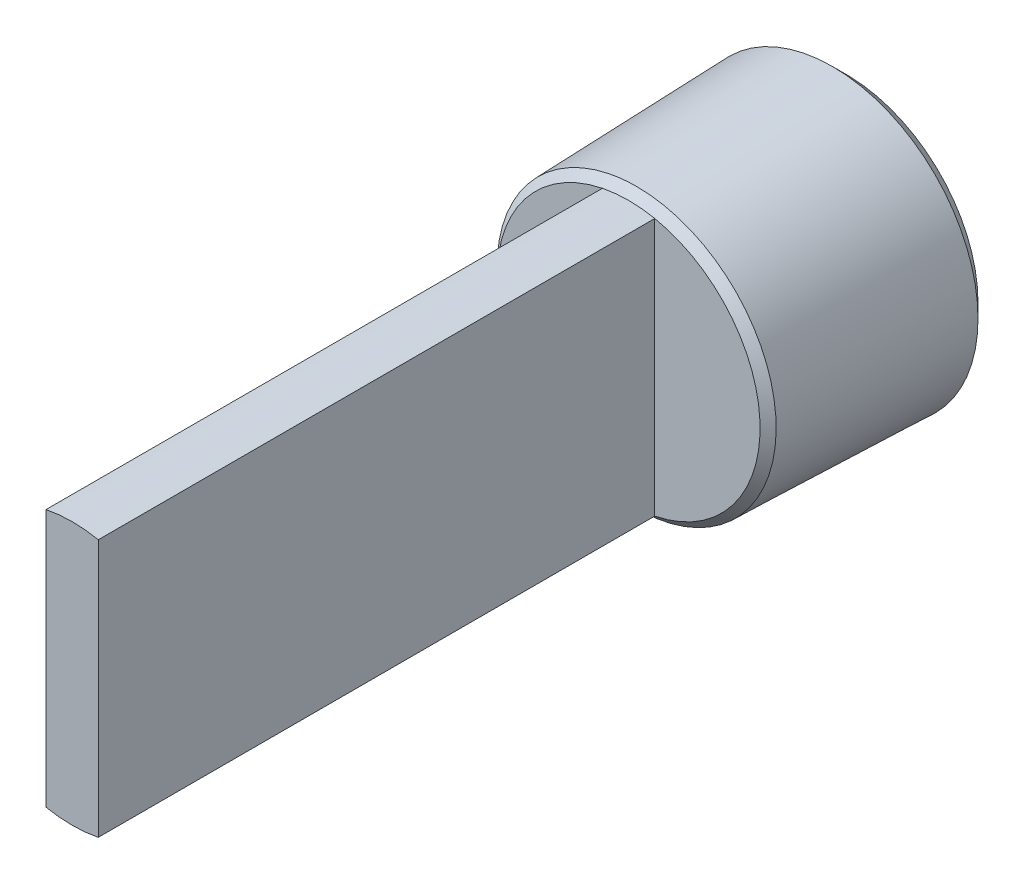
ISO-10303-21;
HEADER;
FILE_DESCRIPTION(('STEP AP214'),'2;1');
FILE_NAME('part.step','',(''),(''),'','','');
FILE_SCHEMA(('AUTOMOTIVE_DESIGN { 1 0 10303 214 1 1 1 1 }'));
ENDSEC;
DATA;
#1=APPLICATION_CONTEXT('core data for automotive mechanical design processes');
#2=APPLICATION_PROTOCOL_DEFINITION('international standard','automotive_design',2000,#1);
#3=PRODUCT_CONTEXT('',#1,'mechanical');
#4=PRODUCT('Part','Part','',(#3));
#5=PRODUCT_RELATED_PRODUCT_CATEGORY('part','',(#4));
#6=PRODUCT_DEFINITION_FORMATION('','',#4);
#7=PRODUCT_DEFINITION_CONTEXT('part definition',#1,'design');
#8=PRODUCT_DEFINITION('design','',#6,#7);
#9=PRODUCT_DEFINITION_SHAPE('','',#8);
#10=(LENGTH_UNIT() NAMED_UNIT(*) SI_UNIT(.MILLI.,.METRE.));
#11=(NAMED_UNIT(*) PLANE_ANGLE_UNIT() SI_UNIT($,.RADIAN.));
#12=(NAMED_UNIT(*) SI_UNIT($,.STERADIAN.) SOLID_ANGLE_UNIT());
#13=UNCERTAINTY_MEASURE_WITH_UNIT(LENGTH_MEASURE(1.E-05),#10,'distance_accuracy_value','');
#14=(GEOMETRIC_REPRESENTATION_CONTEXT(3) GLOBAL_UNCERTAINTY_ASSIGNED_CONTEXT((#13)) GLOBAL_UNIT_ASSIGNED_CONTEXT((#10,
#11,#12)) REPRESENTATION_CONTEXT('',''));
#15=CARTESIAN_POINT('',(0.,0.,0.));
#16=DIRECTION('',(0.,0.,1.));
#17=DIRECTION('',(1.,0.,0.));
#18=AXIS2_PLACEMENT_3D('',#15,#16,#17);
#19=CARTESIAN_POINT('',(-3.,-24.598076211,-14.));
#20=DIRECTION('',(0.,0.,-1.));
#21=DIRECTION('',(0.,1.,0.));
#22=AXIS2_PLACEMENT_3D('',#19,#20,#21);
#23=PLANE('',#22);
#24=DIRECTION('',(-1.,0.,0.));
#25=VECTOR('',#24,1.);
#26=CARTESIAN_POINT('',(0.,-24.598076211,-14.));
#27=LINE('',#26,#25);
#28=CARTESIAN_POINT('',(1.5,-24.598076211,-14.));
#29=VERTEX_POINT('',#28);
#30=CARTESIAN_POINT('',(-1.5,-24.598076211,-14.));
#31=VERTEX_POINT('',#30);
#32=EDGE_CURVE('E159',#29,#31,#27,.T.);
#33=ORIENTED_EDGE('',*,*,#32,.T.);
#34=DIRECTION('',(-0.500000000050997,0.866025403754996,0.));
#35=VECTOR('',#34,1.);
#36=CARTESIAN_POINT('',(-2.25,-23.2990381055,-14.));
#37=LINE('',#36,#35);
#38=CARTESIAN_POINT('',(-2.99999999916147,-21.9999999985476,-14.));
#39=VERTEX_POINT('',#38);
#40=EDGE_CURVE('E162',#31,#39,#37,.T.);
#41=ORIENTED_EDGE('',*,*,#40,.T.);
#42=DIRECTION('',(0.500000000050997,0.866025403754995,0.));
#43=VECTOR('',#42,1.);
#44=CARTESIAN_POINT('',(-2.25,-20.7009618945,-14.));
#45=LINE('',#44,#43);
#46=CARTESIAN_POINT('',(-1.5,-19.401923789,-14.));
#47=VERTEX_POINT('',#46);
#48=EDGE_CURVE('E164',#39,#47,#45,.T.);
#49=ORIENTED_EDGE('',*,*,#48,.T.);
#50=DIRECTION('',(1.,0.,0.));
#51=VECTOR('',#50,1.);
#52=CARTESIAN_POINT('',(0.,-19.401923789,-14.));
#53=LINE('',#52,#51);
#54=CARTESIAN_POINT('',(1.5,-19.401923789,-14.));
#55=VERTEX_POINT('',#54);
#56=EDGE_CURVE('E87',#47,#55,#53,.T.);
#57=ORIENTED_EDGE('',*,*,#56,.T.);
#58=DIRECTION('',(0.500000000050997,-0.866025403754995,0.));
#59=VECTOR('',#58,1.);
#60=CARTESIAN_POINT('',(2.25,-20.7009618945,-14.));
#61=LINE('',#60,#59);
#62=CARTESIAN_POINT('',(2.99999999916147,-21.9999999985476,-14.));
#63=VERTEX_POINT('',#62);
#64=EDGE_CURVE('E152',#55,#63,#61,.T.);
#65=ORIENTED_EDGE('',*,*,#64,.T.);
#66=DIRECTION('',(-0.500000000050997,-0.866025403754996,0.));
#67=VECTOR('',#66,1.);
#68=CARTESIAN_POINT('',(2.25,-23.2990381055,-14.));
#69=LINE('',#68,#67);
#70=EDGE_CURVE('E156',#63,#29,#69,.T.);
#71=ORIENTED_EDGE('',*,*,#70,.T.);
#72=EDGE_LOOP('',(#33,#41,#49,#57,#65,#71));
#73=FACE_BOUND('',#72,.T.);
#74=ADVANCED_FACE('F24',(#73),#23,.T.);
#75=CARTESIAN_POINT('',(-1.5,-19.401923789,-20.));
#76=DIRECTION('',(-0.866025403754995,0.500000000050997,0.));
#77=DIRECTION('',(-0.500000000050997,-0.866025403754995,0.));
#78=AXIS2_PLACEMENT_3D('',#75,#76,#77);
#79=PLANE('',#78);
#80=DIRECTION('',(0.,0.,1.));
#81=VECTOR('',#80,1.);
#82=CARTESIAN_POINT('',(-1.5,-19.401923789,-17.));
#83=LINE('',#82,#81);
#84=CARTESIAN_POINT('',(-1.50000000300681,-19.401923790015,-20.));
#85=VERTEX_POINT('',#84);
#86=EDGE_CURVE('E151',#85,#47,#83,.T.);
#87=ORIENTED_EDGE('',*,*,#86,.T.);
#88=ORIENTED_EDGE('',*,*,#48,.F.);
#89=DIRECTION('',(0.,0.,-1.));
#90=VECTOR('',#89,1.);
#91=CARTESIAN_POINT('',(-3.,-22.,-17.));
#92=LINE('',#91,#90);
#93=CARTESIAN_POINT('',(-2.99999999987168,-21.9999999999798,-20.));
#94=VERTEX_POINT('',#93);
#95=EDGE_CURVE('E161',#39,#94,#92,.T.);
#96=ORIENTED_EDGE('',*,*,#95,.T.);
#97=DIRECTION('',(-0.499999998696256,-0.866025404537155,0.));
#98=VECTOR('',#97,1.);
#99=CARTESIAN_POINT('',(-1.50000000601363,-19.4019237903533,-20.));
#100=LINE('',#99,#98);
#101=EDGE_CURVE('E28',#85,#94,#100,.T.);
#102=ORIENTED_EDGE('',*,*,#101,.F.);
#103=EDGE_LOOP('',(#87,#88,#96,#102));
#104=FACE_BOUND('',#103,.T.);
#105=ADVANCED_FACE('F202',(#104),#79,.F.);
#106=CARTESIAN_POINT('',(-3.,-22.,-20.));
#107=DIRECTION('',(-0.866025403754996,-0.500000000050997,0.));
#108=DIRECTION('',(0.500000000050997,-0.866025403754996,0.));
#109=AXIS2_PLACEMENT_3D('',#106,#107,#108);
#110=PLANE('',#109);
#111=ORIENTED_EDGE('',*,*,#95,.F.);
#112=ORIENTED_EDGE('',*,*,#40,.F.);
#113=DIRECTION('',(0.,0.,-1.));
#114=VECTOR('',#113,1.);
#115=CARTESIAN_POINT('',(-1.5,-24.598076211,-17.));
#116=LINE('',#115,#114);
#117=CARTESIAN_POINT('',(-1.50000000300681,-24.598076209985,-20.));
#118=VERTEX_POINT('',#117);
#119=EDGE_CURVE('E158',#31,#118,#116,.T.);
#120=ORIENTED_EDGE('',*,*,#119,.T.);
#121=DIRECTION('',(0.499999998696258,-0.866025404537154,0.));
#122=VECTOR('',#121,1.);
#123=CARTESIAN_POINT('',(-2.99999999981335,-22.,-20.));
#124=LINE('',#123,#122);
#125=EDGE_CURVE('E179',#94,#118,#124,.T.);
#126=ORIENTED_EDGE('',*,*,#125,.F.);
#127=EDGE_LOOP('',(#111,#112,#120,#126));
#128=FACE_BOUND('',#127,.T.);
#129=ADVANCED_FACE('F206',(#128),#110,.F.);
#130=CARTESIAN_POINT('',(-1.5,-24.598076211,-20.));
#131=DIRECTION('',(0.,-1.,0.));
#132=DIRECTION('',(1.,0.,0.));
#133=AXIS2_PLACEMENT_3D('',#130,#131,#132);
#134=PLANE('',#133);
#135=ORIENTED_EDGE('',*,*,#119,.F.);
#136=ORIENTED_EDGE('',*,*,#32,.F.);
#137=DIRECTION('',(0.,0.,-1.));
#138=VECTOR('',#137,1.);
#139=CARTESIAN_POINT('',(1.5,-24.598076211,-17.));
#140=LINE('',#139,#138);
#141=CARTESIAN_POINT('',(1.50000000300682,-24.598076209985,-20.));
#142=VERTEX_POINT('',#141);
#143=EDGE_CURVE('E155',#29,#142,#140,.T.);
#144=ORIENTED_EDGE('',*,*,#143,.T.);
#145=DIRECTION('',(1.,0.,0.));
#146=VECTOR('',#145,1.);
#147=CARTESIAN_POINT('',(0.,-24.5980762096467,-20.));
#148=LINE('',#147,#146);
#149=EDGE_CURVE('E175',#118,#142,#148,.T.);
#150=ORIENTED_EDGE('',*,*,#149,.F.);
#151=EDGE_LOOP('',(#135,#136,#144,#150));
#152=FACE_BOUND('',#151,.T.);
#153=ADVANCED_FACE('F211',(#152),#134,.F.);
#154=CARTESIAN_POINT('',(1.5,-24.598076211,-20.));
#155=DIRECTION('',(0.866025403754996,-0.500000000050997,0.));
#156=DIRECTION('',(0.500000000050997,0.866025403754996,0.));
#157=AXIS2_PLACEMENT_3D('',#154,#155,#156);
#158=PLANE('',#157);
#159=ORIENTED_EDGE('',*,*,#143,.F.);
#160=ORIENTED_EDGE('',*,*,#70,.F.);
#161=DIRECTION('',(0.,0.,-1.));
#162=VECTOR('',#161,1.);
#163=CARTESIAN_POINT('',(3.,-22.,-17.));
#164=LINE('',#163,#162);
#165=CARTESIAN_POINT('',(2.99999999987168,-21.9999999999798,-20.));
#166=VERTEX_POINT('',#165);
#167=EDGE_CURVE('E154',#63,#166,#164,.T.);
#168=ORIENTED_EDGE('',*,*,#167,.T.);
#169=DIRECTION('',(0.499999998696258,0.866025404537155,0.));
#170=VECTOR('',#169,1.);
#171=CARTESIAN_POINT('',(1.50000000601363,-24.5980762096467,-20.));
#172=LINE('',#171,#170);
#173=EDGE_CURVE('E178',#142,#166,#172,.T.);
#174=ORIENTED_EDGE('',*,*,#173,.F.);
#175=EDGE_LOOP('',(#159,#160,#168,#174));
#176=FACE_BOUND('',#175,.T.);
#177=ADVANCED_FACE('F215',(#176),#158,.F.);
#178=CARTESIAN_POINT('',(3.,-22.,-20.));
#179=DIRECTION('',(0.866025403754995,0.500000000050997,0.));
#180=DIRECTION('',(-0.500000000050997,0.866025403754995,0.));
#181=AXIS2_PLACEMENT_3D('',#178,#179,#180);
#182=PLANE('',#181);
#183=ORIENTED_EDGE('',*,*,#167,.F.);
#184=ORIENTED_EDGE('',*,*,#64,.F.);
#185=DIRECTION('',(0.,0.,-1.));
#186=VECTOR('',#185,1.);
#187=CARTESIAN_POINT('',(1.5,-19.401923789,-17.));
#188=LINE('',#187,#186);
#189=CARTESIAN_POINT('',(1.50000000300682,-19.401923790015,-20.));
#190=VERTEX_POINT('',#189);
#191=EDGE_CURVE('E150',#55,#190,#188,.T.);
#192=ORIENTED_EDGE('',*,*,#191,.T.);
#193=DIRECTION('',(-0.499999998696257,0.866025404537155,0.));
#194=VECTOR('',#193,1.);
#195=CARTESIAN_POINT('',(2.99999999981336,-22.,-20.));
#196=LINE('',#195,#194);
#197=EDGE_CURVE('E171',#166,#190,#196,.T.);
#198=ORIENTED_EDGE('',*,*,#197,.F.);
#199=EDGE_LOOP('',(#183,#184,#192,#198));
#200=FACE_BOUND('',#199,.T.);
#201=ADVANCED_FACE('F219',(#200),#182,.F.);
#202=CARTESIAN_POINT('',(1.5,-19.401923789,-20.));
#203=DIRECTION('',(0.,1.,0.));
#204=DIRECTION('',(-1.,0.,0.));
#205=AXIS2_PLACEMENT_3D('',#202,#203,#204);
#206=PLANE('',#205);
#207=ORIENTED_EDGE('',*,*,#191,.F.);
#208=ORIENTED_EDGE('',*,*,#56,.F.);
#209=ORIENTED_EDGE('',*,*,#86,.F.);
#210=DIRECTION('',(-1.,0.,0.));
#211=VECTOR('',#210,1.);
#212=CARTESIAN_POINT('',(0.,-19.4019237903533,-20.));
#213=LINE('',#212,#211);
#214=EDGE_CURVE('E168',#190,#85,#213,.T.);
#215=ORIENTED_EDGE('',*,*,#214,.F.);
#216=EDGE_LOOP('',(#207,#208,#209,#215));
#217=FACE_BOUND('',#216,.T.);
#218=ADVANCED_FACE('F200',(#217),#206,.F.);
#219=CARTESIAN_POINT('',(-6.1069525,-28.1069525,-20.));
#220=DIRECTION('',(0.,0.,-1.));
#221=DIRECTION('',(0.,1.,0.));
#222=AXIS2_PLACEMENT_3D('',#219,#220,#221);
#223=PLANE('',#222);
#224=ORIENTED_EDGE('',*,*,#197,.T.);
#225=ORIENTED_EDGE('',*,*,#214,.T.);
#226=ORIENTED_EDGE('',*,*,#101,.T.);
#227=ORIENTED_EDGE('',*,*,#125,.T.);
#228=ORIENTED_EDGE('',*,*,#149,.T.);
#229=ORIENTED_EDGE('',*,*,#173,.T.);
#230=EDGE_LOOP('',(#224,#225,#226,#227,#228,#229));
#231=FACE_BOUND('',#230,.T.);
#232=CARTESIAN_POINT('',(0.,-22.,-20.));
#233=DIRECTION('',(0.,0.,1.));
#234=DIRECTION('',(1.,0.,0.));
#235=AXIS2_PLACEMENT_3D('',#232,#233,#234);
#236=CIRCLE('',#235,6.03453804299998);
#237=CARTESIAN_POINT('',(6.03453804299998,-22.,-20.));
#238=VERTEX_POINT('',#237);
#239=EDGE_CURVE('E148',#238,#238,#236,.F.);
#240=ORIENTED_EDGE('',*,*,#239,.T.);
#241=EDGE_LOOP('',(#240));
#242=FACE_BOUND('',#241,.T.);
#243=ADVANCED_FACE('F194',(#231,#242),#223,.T.);
#244=CARTESIAN_POINT('',(0.,-22.,-20.));
#245=DIRECTION('',(0.,0.,1.));
#246=DIRECTION('',(1.,0.,0.));
#247=AXIS2_PLACEMENT_3D('',#244,#245,#246);
#248=CONICAL_SURFACE('',#247,6.034538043,0.785398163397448);
#249=ORIENTED_EDGE('',*,*,#239,.F.);
#250=EDGE_LOOP('',(#249));
#251=FACE_BOUND('',#250,.T.);
#252=CARTESIAN_POINT('',(0.,-22.,-19.351684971));
#253=DIRECTION('',(0.,0.,-1.));
#254=DIRECTION('',(0.,1.,0.));
#255=AXIS2_PLACEMENT_3D('',#252,#253,#254);
#256=CIRCLE('',#255,6.682853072);
#257=CARTESIAN_POINT('',(0.,-15.317146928,-19.351684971));
#258=VERTEX_POINT('',#257);
#259=EDGE_CURVE('E145',#258,#258,#256,.T.);
#260=ORIENTED_EDGE('',*,*,#259,.T.);
#261=EDGE_LOOP('',(#260));
#262=FACE_BOUND('',#261,.T.);
#263=ADVANCED_FACE('F246',(#251,#262),#248,.T.);
#264=CARTESIAN_POINT('',(0.,-22.,-10.368632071));
#265=DIRECTION('',(0.,0.,-1.));
#266=DIRECTION('',(-1.,0.,0.));
#267=AXIS2_PLACEMENT_3D('',#264,#265,#266);
#268=CONICAL_SURFACE('',#267,6.403170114,0.0311244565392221);
#269=CARTESIAN_POINT('',(0.,-22.,-10.368632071));
#270=DIRECTION('',(0.,0.,-1.));
#271=DIRECTION('',(0.,1.,0.));
#272=AXIS2_PLACEMENT_3D('',#269,#270,#271);
#273=CIRCLE('',#272,6.403170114);
#274=CARTESIAN_POINT('',(0.,-15.596829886,-10.368632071));
#275=VERTEX_POINT('',#274);
#276=EDGE_CURVE('E140',#275,#275,#273,.T.);
#277=ORIENTED_EDGE('',*,*,#276,.T.);
#278=EDGE_LOOP('',(#277));
#279=FACE_BOUND('',#278,.T.);
#280=ORIENTED_EDGE('',*,*,#259,.F.);
#281=EDGE_LOOP('',(#280));
#282=FACE_BOUND('',#281,.T.);
#283=ADVANCED_FACE('F243',(#279,#282),#268,.T.);
#284=CARTESIAN_POINT('',(0.,-22.,-10.));
#285=DIRECTION('',(0.,0.,-1.));
#286=DIRECTION('',(-1.,0.,0.));
#287=AXIS2_PLACEMENT_3D('',#284,#285,#286);
#288=CONICAL_SURFACE('',#287,6.034538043,0.785398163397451);
#289=CARTESIAN_POINT('',(0.,-22.,-10.));
#290=DIRECTION('',(0.,0.,1.));
#291=DIRECTION('',(0.,-1.,0.));
#292=AXIS2_PLACEMENT_3D('',#289,#290,#291);
#293=CIRCLE('',#292,6.034538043);
#294=CARTESIAN_POINT('',(-1.20000000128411,-16.0859785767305,-10.));
#295=VERTEX_POINT('',#294);
#296=CARTESIAN_POINT('',(1.20000000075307,-16.0859785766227,-10.));
#297=VERTEX_POINT('',#296);
#298=EDGE_CURVE('E127',#295,#297,#293,.F.);
#299=ORIENTED_EDGE('',*,*,#298,.T.);
#300=CARTESIAN_POINT('',(0.,-22.,-10.));
#301=DIRECTION('',(0.,0.,-1.));
#302=DIRECTION('',(-1.,0.,0.));
#303=AXIS2_PLACEMENT_3D('',#300,#301,#302);
#304=CIRCLE('',#303,6.034538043);
#305=CARTESIAN_POINT('',(1.20000000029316,-27.9140214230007,-10.));
#306=VERTEX_POINT('',#305);
#307=EDGE_CURVE('E139',#306,#297,#304,.F.);
#308=ORIENTED_EDGE('',*,*,#307,.F.);
#309=CARTESIAN_POINT('',(0.,-22.,-10.));
#310=DIRECTION('',(0.,0.,-1.));
#311=DIRECTION('',(0.,1.,0.));
#312=AXIS2_PLACEMENT_3D('',#309,#310,#311);
#313=CIRCLE('',#312,6.034538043);
#314=CARTESIAN_POINT('',(-1.20000000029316,-27.9140214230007,-10.));
#315=VERTEX_POINT('',#314);
#316=EDGE_CURVE('E137',#315,#306,#313,.F.);
#317=ORIENTED_EDGE('',*,*,#316,.F.);
#318=CARTESIAN_POINT('',(0.,-22.,-10.));
#319=DIRECTION('',(0.,0.,-1.));
#320=DIRECTION('',(-1.,0.,0.));
#321=AXIS2_PLACEMENT_3D('',#318,#319,#320);
#322=CIRCLE('',#321,6.03453804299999);
#323=EDGE_CURVE('E116',#295,#315,#322,.F.);
#324=ORIENTED_EDGE('',*,*,#323,.F.);
#325=EDGE_LOOP('',(#299,#308,#317,#324));
#326=FACE_BOUND('',#325,.T.);
#327=ORIENTED_EDGE('',*,*,#276,.F.);
#328=EDGE_LOOP('',(#327));
#329=FACE_BOUND('',#328,.T.);
#330=ADVANCED_FACE('F239',(#326,#329),#288,.T.);
#331=CARTESIAN_POINT('',(1.2,-16.015010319,-10.));
#332=DIRECTION('',(0.,0.,1.));
#333=DIRECTION('',(0.,-1.,0.));
#334=AXIS2_PLACEMENT_3D('',#331,#332,#333);
#335=PLANE('',#334);
#336=ORIENTED_EDGE('',*,*,#307,.T.);
#337=DIRECTION('',(0.,1.,0.));
#338=VECTOR('',#337,1.);
#339=CARTESIAN_POINT('',(1.2,-22.,-10.));
#340=LINE('',#339,#338);
#341=EDGE_CURVE('E115',#306,#297,#340,.T.);
#342=ORIENTED_EDGE('',*,*,#341,.F.);
#343=EDGE_LOOP('',(#336,#342));
#344=FACE_BOUND('',#343,.T.);
#345=ADVANCED_FACE('F242',(#344),#335,.T.);
#346=CARTESIAN_POINT('',(-1.2,-15.8930475,15.535898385));
#347=DIRECTION('',(0.,0.,-1.));
#348=DIRECTION('',(1.,0.,0.));
#349=AXIS2_PLACEMENT_3D('',#346,#347,#348);
#350=PLANE('',#349);
#351=DIRECTION('',(0.,1.,0.));
#352=VECTOR('',#351,1.);
#353=CARTESIAN_POINT('',(-1.2,-22.,15.535898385));
#354=LINE('',#353,#352);
#355=CARTESIAN_POINT('',(-1.20000000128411,-27.9140214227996,15.535898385));
#356=VERTEX_POINT('',#355);
#357=CARTESIAN_POINT('',(-1.2,-16.0859785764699,15.535898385));
#358=VERTEX_POINT('',#357);
#359=EDGE_CURVE('E131',#356,#358,#354,.T.);
#360=ORIENTED_EDGE('',*,*,#359,.F.);
#361=CARTESIAN_POINT('',(0.,-22.,15.535898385));
#362=DIRECTION('',(0.,0.,1.));
#363=DIRECTION('',(1.,0.,0.));
#364=AXIS2_PLACEMENT_3D('',#361,#362,#363);
#365=CIRCLE('',#364,6.034538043);
#366=CARTESIAN_POINT('',(1.20000000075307,-27.9140214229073,15.535898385));
#367=VERTEX_POINT('',#366);
#368=EDGE_CURVE('E43',#367,#356,#365,.F.);
#369=ORIENTED_EDGE('',*,*,#368,.F.);
#370=DIRECTION('',(0.,-1.,0.));
#371=VECTOR('',#370,1.);
#372=CARTESIAN_POINT('',(1.2,-22.,15.535898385));
#373=LINE('',#372,#371);
#374=CARTESIAN_POINT('',(1.2,-16.0859785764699,15.535898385));
#375=VERTEX_POINT('',#374);
#376=EDGE_CURVE('E107',#375,#367,#373,.T.);
#377=ORIENTED_EDGE('',*,*,#376,.F.);
#378=CARTESIAN_POINT('',(0.,-22.,15.535898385));
#379=DIRECTION('',(0.,0.,1.));
#380=DIRECTION('',(1.,0.,0.));
#381=AXIS2_PLACEMENT_3D('',#378,#379,#380);
#382=CIRCLE('',#381,6.034538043);
#383=EDGE_CURVE('E110',#375,#358,#382,.T.);
#384=ORIENTED_EDGE('',*,*,#383,.T.);
#385=EDGE_LOOP('',(#360,#369,#377,#384));
#386=FACE_BOUND('',#385,.T.);
#387=ADVANCED_FACE('F109',(#386),#350,.F.);
#388=CARTESIAN_POINT('',(0.,-22.,-10.));
#389=DIRECTION('',(0.,0.,1.));
#390=DIRECTION('',(1.,0.,0.));
#391=AXIS2_PLACEMENT_3D('',#388,#389,#390);
#392=CYLINDRICAL_SURFACE('',#391,6.034538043);
#393=DIRECTION('',(0.,0.,1.));
#394=VECTOR('',#393,1.);
#395=CARTESIAN_POINT('',(1.2,-16.085978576,2.7679491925));
#396=LINE('',#395,#394);
#397=EDGE_CURVE('E122',#297,#375,#396,.T.);
#398=ORIENTED_EDGE('',*,*,#397,.F.);
#399=ORIENTED_EDGE('',*,*,#298,.F.);
#400=DIRECTION('',(0.,0.,-1.));
#401=VECTOR('',#400,1.);
#402=CARTESIAN_POINT('',(-1.2,-16.085978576,2.7679491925));
#403=LINE('',#402,#401);
#404=EDGE_CURVE('E125',#358,#295,#403,.T.);
#405=ORIENTED_EDGE('',*,*,#404,.F.);
#406=ORIENTED_EDGE('',*,*,#383,.F.);
#407=EDGE_LOOP('',(#398,#399,#405,#406));
#408=FACE_BOUND('',#407,.T.);
#409=ADVANCED_FACE('F120',(#408),#392,.T.);
#410=CARTESIAN_POINT('',(-6.063545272,-16.015010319,-10.));
#411=DIRECTION('',(0.,0.,1.));
#412=DIRECTION('',(0.,-1.,0.));
#413=AXIS2_PLACEMENT_3D('',#410,#411,#412);
#414=PLANE('',#413);
#415=ORIENTED_EDGE('',*,*,#323,.T.);
#416=DIRECTION('',(0.,-1.,0.));
#417=VECTOR('',#416,1.);
#418=CARTESIAN_POINT('',(-1.2,-22.,-10.));
#419=LINE('',#418,#417);
#420=EDGE_CURVE('E350',#295,#315,#419,.T.);
#421=ORIENTED_EDGE('',*,*,#420,.F.);
#422=EDGE_LOOP('',(#415,#421));
#423=FACE_BOUND('',#422,.T.);
#424=ADVANCED_FACE('F238',(#423),#414,.T.);
#425=CARTESIAN_POINT('',(1.2,-27.914021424,-10.));
#426=DIRECTION('',(1.,0.,0.));
#427=DIRECTION('',(0.,1.,0.));
#428=AXIS2_PLACEMENT_3D('',#425,#426,#427);
#429=PLANE('',#428);
#430=ORIENTED_EDGE('',*,*,#341,.T.);
#431=ORIENTED_EDGE('',*,*,#397,.T.);
#432=ORIENTED_EDGE('',*,*,#376,.T.);
#433=DIRECTION('',(0.,0.,1.));
#434=VECTOR('',#433,1.);
#435=CARTESIAN_POINT('',(1.20000000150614,-27.9140214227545,2.7679491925));
#436=LINE('',#435,#434);
#437=EDGE_CURVE('E34',#367,#306,#436,.F.);
#438=ORIENTED_EDGE('',*,*,#437,.T.);
#439=EDGE_LOOP('',(#430,#431,#432,#438));
#440=FACE_BOUND('',#439,.T.);
#441=ADVANCED_FACE('F129',(#440),#429,.T.);
#442=CARTESIAN_POINT('',(-1.2,-16.085978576,-10.));
#443=DIRECTION('',(-1.,0.,0.));
#444=DIRECTION('',(0.,-1.,0.));
#445=AXIS2_PLACEMENT_3D('',#442,#443,#444);
#446=PLANE('',#445);
#447=ORIENTED_EDGE('',*,*,#420,.T.);
#448=DIRECTION('',(0.,0.,-1.));
#449=VECTOR('',#448,1.);
#450=CARTESIAN_POINT('',(-1.20000000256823,-27.914021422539,2.7679491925));
#451=LINE('',#450,#449);
#452=EDGE_CURVE('E13',#315,#356,#451,.F.);
#453=ORIENTED_EDGE('',*,*,#452,.T.);
#454=ORIENTED_EDGE('',*,*,#359,.T.);
#455=ORIENTED_EDGE('',*,*,#404,.T.);
#456=EDGE_LOOP('',(#447,#453,#454,#455));
#457=FACE_BOUND('',#456,.T.);
#458=ADVANCED_FACE('F26',(#457),#446,.T.);
#459=CARTESIAN_POINT('',(0.,-22.,-10.));
#460=DIRECTION('',(0.,0.,1.));
#461=DIRECTION('',(1.,0.,0.));
#462=AXIS2_PLACEMENT_3D('',#459,#460,#461);
#463=CYLINDRICAL_SURFACE('',#462,6.034538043);
#464=ORIENTED_EDGE('',*,*,#316,.T.);
#465=ORIENTED_EDGE('',*,*,#437,.F.);
#466=ORIENTED_EDGE('',*,*,#368,.T.);
#467=ORIENTED_EDGE('',*,*,#452,.F.);
#468=EDGE_LOOP('',(#464,#465,#466,#467));
#469=FACE_BOUND('',#468,.T.);
#470=ADVANCED_FACE('F228',(#469),#463,.T.);
#471=CLOSED_SHELL('',(#74,#105,#129,#153,#177,#201,#218,#243,#263,#283,#330,#345,#387,#409,#424,
#441,#458,#470));
#472=MANIFOLD_SOLID_BREP('B1',#471);
#473=ADVANCED_BREP_SHAPE_REPRESENTATION('',(#18,#472),#14);
#474=SHAPE_DEFINITION_REPRESENTATION(#9,#473);
ENDSEC;
END-ISO-10303-21;
